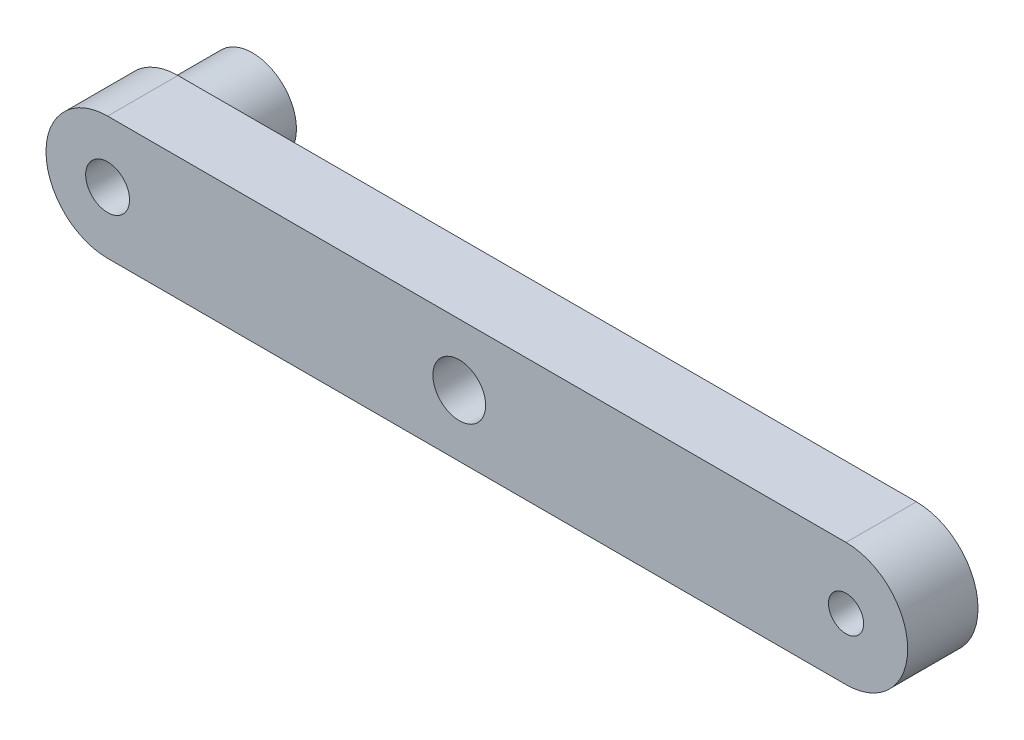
from build123d import *

# Parameters (mm, degrees)
SKETCH2_R           = 3.9624
SKETCH2_R_2         = 4.7625
SKETCH2_R_3         = 3.175
BOSS_EXTRUDE1_DEPTH = 12.7
SKETCH3_R           = 7.9375
BOSS_EXTRUDE2_DEPTH = 13.462


with BuildPart() as part:
    # Sketch2 → Boss-Extrude1 (new body)
    with BuildSketch(Plane.XY):
        with BuildLine():
            Line((-63.5, -11.1252), (69.85, -11.1252))
            ThreePointArc((69.85, -11.1252), (80.9752, 0), (69.85, 11.1252))
            Line((69.85, 11.1252), (-63.5, 11.1252))
            ThreePointArc((-63.5, 11.1252), (-74.6252, 0), (-63.5, -11.1252))
        make_face()
        with Locations((-63.5, 0)):
            Circle(SKETCH2_R, mode=Mode.SUBTRACT)
        Circle(SKETCH2_R_2, mode=Mode.SUBTRACT)
        with Locations((69.85, 0)):
            Circle(SKETCH2_R_3, mode=Mode.SUBTRACT)
    extrude(amount=BOSS_EXTRUDE1_DEPTH)


with BuildPart() as body_2:
    # Sketch3 → Boss-Extrude2 (new body)
    with BuildSketch(Plane.XY):
        with Locations((-63.5, 0)):
            Circle(SKETCH3_R)
    extrude(amount=-BOSS_EXTRUDE2_DEPTH)


solid = Compound([part.part, body_2.part])
